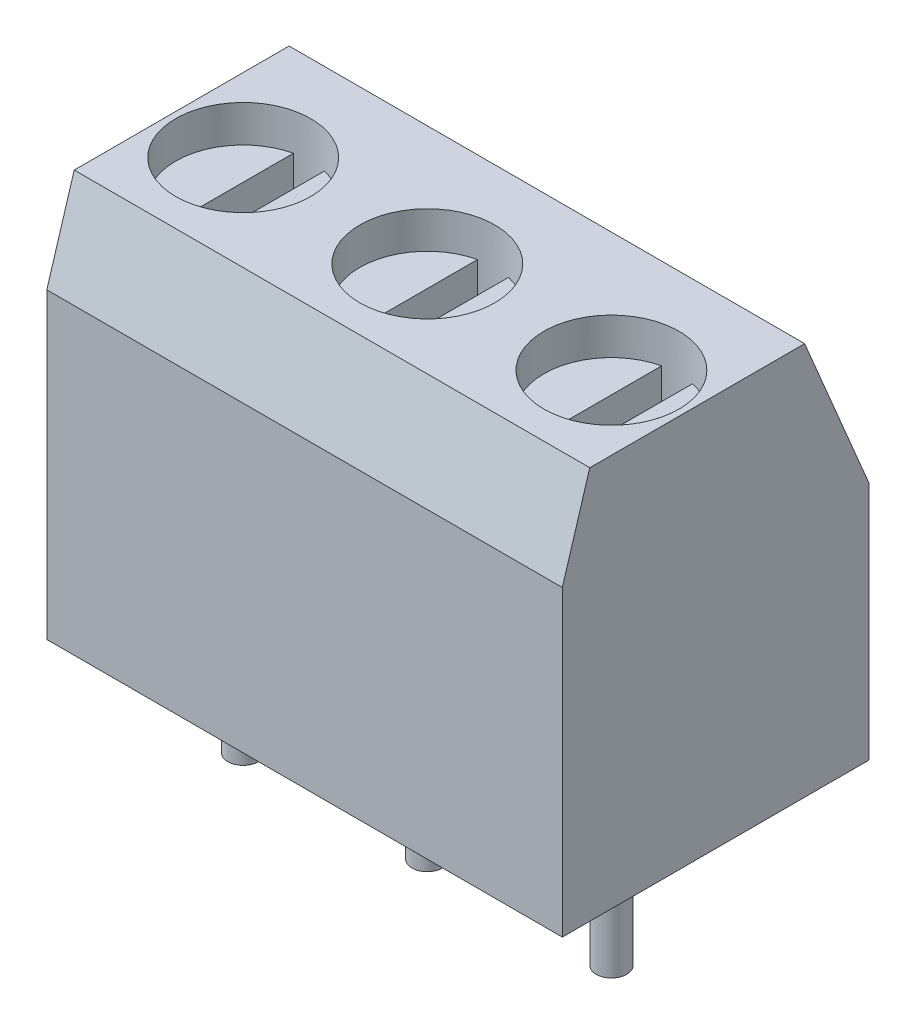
ISO-10303-21;
HEADER;
FILE_DESCRIPTION(('STEP AP214'),'2;1');
FILE_NAME('part.step','',(''),(''),'','','');
FILE_SCHEMA(('AUTOMOTIVE_DESIGN { 1 0 10303 214 1 1 1 1 }'));
ENDSEC;
DATA;
#1=APPLICATION_CONTEXT('core data for automotive mechanical design processes');
#2=APPLICATION_PROTOCOL_DEFINITION('international standard','automotive_design',2000,#1);
#3=PRODUCT_CONTEXT('',#1,'mechanical');
#4=PRODUCT('Part','Part','',(#3));
#5=PRODUCT_RELATED_PRODUCT_CATEGORY('part','',(#4));
#6=PRODUCT_DEFINITION_FORMATION('','',#4);
#7=PRODUCT_DEFINITION_CONTEXT('part definition',#1,'design');
#8=PRODUCT_DEFINITION('design','',#6,#7);
#9=PRODUCT_DEFINITION_SHAPE('','',#8);
#10=(LENGTH_UNIT() NAMED_UNIT(*) SI_UNIT(.MILLI.,.METRE.));
#11=(NAMED_UNIT(*) PLANE_ANGLE_UNIT() SI_UNIT($,.RADIAN.));
#12=(NAMED_UNIT(*) SI_UNIT($,.STERADIAN.) SOLID_ANGLE_UNIT());
#13=UNCERTAINTY_MEASURE_WITH_UNIT(LENGTH_MEASURE(1.E-05),#10,'distance_accuracy_value','');
#14=(GEOMETRIC_REPRESENTATION_CONTEXT(3) GLOBAL_UNCERTAINTY_ASSIGNED_CONTEXT((#13)) GLOBAL_UNIT_ASSIGNED_CONTEXT((#10,
#11,#12)) REPRESENTATION_CONTEXT('',''));
#15=CARTESIAN_POINT('',(0.,0.,0.));
#16=DIRECTION('',(0.,0.,1.));
#17=DIRECTION('',(1.,0.,0.));
#18=AXIS2_PLACEMENT_3D('',#15,#16,#17);
#19=CARTESIAN_POINT('',(47.6665117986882,8.128,-51.8858533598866));
#20=DIRECTION('',(0.,1.,0.));
#21=DIRECTION('',(1.,0.,0.));
#22=AXIS2_PLACEMENT_3D('',#19,#20,#21);
#23=PLANE('',#22);
#24=CARTESIAN_POINT('',(48.006,8.128,-53.34));
#25=DIRECTION('',(0.,1.,0.));
#26=DIRECTION('',(0.,0.,1.));
#27=AXIS2_PLACEMENT_3D('',#24,#25,#26);
#28=CIRCLE('',#27,1.397);
#29=CARTESIAN_POINT('',(47.6861542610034,8.12800000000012,-51.9801074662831));
#30=VERTEX_POINT('',#29);
#31=CARTESIAN_POINT('',(48.3258457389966,8.12800000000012,-51.9801074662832));
#32=VERTEX_POINT('',#31);
#33=EDGE_CURVE('E132',#30,#32,#28,.T.);
#34=ORIENTED_EDGE('',*,*,#33,.T.);
#35=DIRECTION('',(0.,0.,-1.));
#36=VECTOR('',#35,1.);
#37=CARTESIAN_POINT('',(48.3258457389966,8.12800000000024,-53.34));
#38=LINE('',#37,#36);
#39=CARTESIAN_POINT('',(48.3258457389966,8.12800000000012,-54.6998925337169));
#40=VERTEX_POINT('',#39);
#41=EDGE_CURVE('E136',#32,#40,#38,.T.);
#42=ORIENTED_EDGE('',*,*,#41,.T.);
#43=CARTESIAN_POINT('',(48.006,8.128,-53.34));
#44=DIRECTION('',(0.,1.,0.));
#45=DIRECTION('',(0.,0.,1.));
#46=AXIS2_PLACEMENT_3D('',#43,#44,#45);
#47=CIRCLE('',#46,1.397);
#48=CARTESIAN_POINT('',(47.6861542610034,8.12800000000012,-54.6998925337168));
#49=VERTEX_POINT('',#48);
#50=EDGE_CURVE('E20',#40,#49,#47,.T.);
#51=ORIENTED_EDGE('',*,*,#50,.T.);
#52=DIRECTION('',(0.,0.,1.));
#53=VECTOR('',#52,1.);
#54=CARTESIAN_POINT('',(47.6861542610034,8.12800000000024,-53.34));
#55=LINE('',#54,#53);
#56=EDGE_CURVE('E150',#49,#30,#55,.T.);
#57=ORIENTED_EDGE('',*,*,#56,.T.);
#58=EDGE_LOOP('',(#34,#42,#51,#57));
#59=FACE_BOUND('',#58,.T.);
#60=ADVANCED_FACE('F16',(#59),#23,.T.);
#61=CARTESIAN_POINT('',(43.8565117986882,8.128,-51.8858533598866));
#62=DIRECTION('',(0.,1.,0.));
#63=DIRECTION('',(1.,0.,0.));
#64=AXIS2_PLACEMENT_3D('',#61,#62,#63);
#65=PLANE('',#64);
#66=CARTESIAN_POINT('',(44.196,8.128,-53.34));
#67=DIRECTION('',(0.,1.,0.));
#68=DIRECTION('',(0.,0.,1.));
#69=AXIS2_PLACEMENT_3D('',#66,#67,#68);
#70=CIRCLE('',#69,1.397);
#71=CARTESIAN_POINT('',(43.8761542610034,8.12800000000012,-51.9801074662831));
#72=VERTEX_POINT('',#71);
#73=CARTESIAN_POINT('',(44.5158457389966,8.12800000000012,-51.9801074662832));
#74=VERTEX_POINT('',#73);
#75=EDGE_CURVE('E247',#72,#74,#70,.T.);
#76=ORIENTED_EDGE('',*,*,#75,.T.);
#77=DIRECTION('',(0.,0.,-1.));
#78=VECTOR('',#77,1.);
#79=CARTESIAN_POINT('',(44.5158457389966,8.12800000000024,-53.34));
#80=LINE('',#79,#78);
#81=CARTESIAN_POINT('',(44.5158457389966,8.12800000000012,-54.6998925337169));
#82=VERTEX_POINT('',#81);
#83=EDGE_CURVE('E256',#74,#82,#80,.T.);
#84=ORIENTED_EDGE('',*,*,#83,.T.);
#85=CARTESIAN_POINT('',(44.196,8.128,-53.34));
#86=DIRECTION('',(0.,1.,0.));
#87=DIRECTION('',(0.,0.,1.));
#88=AXIS2_PLACEMENT_3D('',#85,#86,#87);
#89=CIRCLE('',#88,1.397);
#90=CARTESIAN_POINT('',(43.8761542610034,8.12800000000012,-54.6998925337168));
#91=VERTEX_POINT('',#90);
#92=EDGE_CURVE('E249',#82,#91,#89,.T.);
#93=ORIENTED_EDGE('',*,*,#92,.T.);
#94=DIRECTION('',(0.,0.,1.));
#95=VECTOR('',#94,1.);
#96=CARTESIAN_POINT('',(43.8761542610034,8.12800000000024,-53.34));
#97=LINE('',#96,#95);
#98=EDGE_CURVE('E148',#91,#72,#97,.T.);
#99=ORIENTED_EDGE('',*,*,#98,.T.);
#100=EDGE_LOOP('',(#76,#84,#93,#99));
#101=FACE_BOUND('',#100,.T.);
#102=ADVANCED_FACE('F254',(#101),#65,.T.);
#103=CARTESIAN_POINT('',(40.0465117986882,8.128,-51.8858533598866));
#104=DIRECTION('',(0.,1.,0.));
#105=DIRECTION('',(1.,0.,0.));
#106=AXIS2_PLACEMENT_3D('',#103,#104,#105);
#107=PLANE('',#106);
#108=CARTESIAN_POINT('',(40.386,8.128,-53.34));
#109=DIRECTION('',(0.,1.,0.));
#110=DIRECTION('',(0.,0.,1.));
#111=AXIS2_PLACEMENT_3D('',#108,#109,#110);
#112=CIRCLE('',#111,1.397);
#113=CARTESIAN_POINT('',(40.0661542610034,8.12800000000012,-51.9801074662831));
#114=VERTEX_POINT('',#113);
#115=CARTESIAN_POINT('',(40.7058457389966,8.12800000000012,-51.9801074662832));
#116=VERTEX_POINT('',#115);
#117=EDGE_CURVE('E243',#114,#116,#112,.T.);
#118=ORIENTED_EDGE('',*,*,#117,.T.);
#119=DIRECTION('',(0.,0.,-1.));
#120=VECTOR('',#119,1.);
#121=CARTESIAN_POINT('',(40.7058457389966,8.12800000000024,-53.34));
#122=LINE('',#121,#120);
#123=CARTESIAN_POINT('',(40.7058457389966,8.12800000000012,-54.6998925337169));
#124=VERTEX_POINT('',#123);
#125=EDGE_CURVE('E276',#116,#124,#122,.T.);
#126=ORIENTED_EDGE('',*,*,#125,.T.);
#127=CARTESIAN_POINT('',(40.386,8.128,-53.34));
#128=DIRECTION('',(0.,1.,0.));
#129=DIRECTION('',(0.,0.,1.));
#130=AXIS2_PLACEMENT_3D('',#127,#128,#129);
#131=CIRCLE('',#130,1.397);
#132=CARTESIAN_POINT('',(40.0661542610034,8.12800000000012,-54.6998925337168));
#133=VERTEX_POINT('',#132);
#134=EDGE_CURVE('E245',#124,#133,#131,.T.);
#135=ORIENTED_EDGE('',*,*,#134,.T.);
#136=DIRECTION('',(0.,0.,1.));
#137=VECTOR('',#136,1.);
#138=CARTESIAN_POINT('',(40.0661542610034,8.12800000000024,-53.34));
#139=LINE('',#138,#137);
#140=EDGE_CURVE('E280',#133,#114,#139,.T.);
#141=ORIENTED_EDGE('',*,*,#140,.T.);
#142=EDGE_LOOP('',(#118,#126,#135,#141));
#143=FACE_BOUND('',#142,.T.);
#144=ADVANCED_FACE('F1044',(#143),#107,.T.);
#145=CARTESIAN_POINT('',(39.33444,2.88544,-52.07));
#146=DIRECTION('',(0.,0.,1.));
#147=DIRECTION('',(1.,0.,0.));
#148=AXIS2_PLACEMENT_3D('',#145,#146,#147);
#149=PLANE('',#148);
#150=CARTESIAN_POINT('',(40.259,3.80999999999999,-52.0700000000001));
#151=DIRECTION('',(0.,0.,1.));
#152=DIRECTION('',(0.,-1.,0.));
#153=AXIS2_PLACEMENT_3D('',#150,#151,#152);
#154=CIRCLE('',#153,0.889000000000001);
#155=CARTESIAN_POINT('',(40.259,2.92099999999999,-52.0700000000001));
#156=VERTEX_POINT('',#155);
#157=EDGE_CURVE('E239',#156,#156,#154,.T.);
#158=ORIENTED_EDGE('',*,*,#157,.F.);
#159=EDGE_LOOP('',(#158));
#160=FACE_BOUND('',#159,.T.);
#161=ADVANCED_FACE('F1034',(#160),#149,.F.);
#162=CARTESIAN_POINT('',(43.14444,2.88544,-52.07));
#163=DIRECTION('',(0.,0.,1.));
#164=DIRECTION('',(1.,0.,0.));
#165=AXIS2_PLACEMENT_3D('',#162,#163,#164);
#166=PLANE('',#165);
#167=CARTESIAN_POINT('',(44.069,3.80999999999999,-52.0700000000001));
#168=DIRECTION('',(0.,0.,1.));
#169=DIRECTION('',(0.,-1.,0.));
#170=AXIS2_PLACEMENT_3D('',#167,#168,#169);
#171=CIRCLE('',#170,0.889000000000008);
#172=CARTESIAN_POINT('',(44.069,2.92099999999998,-52.0700000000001));
#173=VERTEX_POINT('',#172);
#174=EDGE_CURVE('E236',#173,#173,#171,.T.);
#175=ORIENTED_EDGE('',*,*,#174,.F.);
#176=EDGE_LOOP('',(#175));
#177=FACE_BOUND('',#176,.T.);
#178=ADVANCED_FACE('F1024',(#177),#166,.F.);
#179=CARTESIAN_POINT('',(46.95444,2.88544,-52.07));
#180=DIRECTION('',(0.,0.,1.));
#181=DIRECTION('',(1.,0.,0.));
#182=AXIS2_PLACEMENT_3D('',#179,#180,#181);
#183=PLANE('',#182);
#184=CARTESIAN_POINT('',(47.879,3.80999999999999,-52.0700000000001));
#185=DIRECTION('',(0.,0.,1.));
#186=DIRECTION('',(0.,-1.,0.));
#187=AXIS2_PLACEMENT_3D('',#184,#185,#186);
#188=CIRCLE('',#187,0.889000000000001);
#189=CARTESIAN_POINT('',(47.879,2.92099999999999,-52.0700000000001));
#190=VERTEX_POINT('',#189);
#191=EDGE_CURVE('E232',#190,#190,#188,.T.);
#192=ORIENTED_EDGE('',*,*,#191,.F.);
#193=EDGE_LOOP('',(#192));
#194=FACE_BOUND('',#193,.T.);
#195=ADVANCED_FACE('F1014',(#194),#183,.F.);
#196=CARTESIAN_POINT('',(47.6861542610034,8.10835753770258,-54.7542882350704));
#197=DIRECTION('',(-1.,0.,0.));
#198=DIRECTION('',(0.,0.,1.));
#199=AXIS2_PLACEMENT_3D('',#196,#197,#198);
#200=PLANE('',#199);
#201=ORIENTED_EDGE('',*,*,#56,.F.);
#202=DIRECTION('',(0.,-1.,0.));
#203=VECTOR('',#202,1.);
#204=CARTESIAN_POINT('',(47.6861542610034,8.509,-54.6998925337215));
#205=LINE('',#204,#203);
#206=CARTESIAN_POINT('',(47.6861542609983,8.89,-54.6998925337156));
#207=VERTEX_POINT('',#206);
#208=EDGE_CURVE('E127',#207,#49,#205,.T.);
#209=ORIENTED_EDGE('',*,*,#208,.F.);
#210=DIRECTION('',(0.,0.,-1.));
#211=VECTOR('',#210,1.);
#212=CARTESIAN_POINT('',(47.6861542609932,8.89,-53.34));
#213=LINE('',#212,#211);
#214=CARTESIAN_POINT('',(47.6861542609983,8.89,-51.9801074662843));
#215=VERTEX_POINT('',#214);
#216=EDGE_CURVE('E235',#215,#207,#213,.T.);
#217=ORIENTED_EDGE('',*,*,#216,.F.);
#218=DIRECTION('',(0.,1.,0.));
#219=VECTOR('',#218,1.);
#220=CARTESIAN_POINT('',(47.6861542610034,8.509,-51.9801074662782));
#221=LINE('',#220,#219);
#222=EDGE_CURVE('E144',#30,#215,#221,.T.);
#223=ORIENTED_EDGE('',*,*,#222,.F.);
#224=EDGE_LOOP('',(#201,#209,#217,#223));
#225=FACE_BOUND('',#224,.T.);
#226=ADVANCED_FACE('F1005',(#225),#200,.F.);
#227=CARTESIAN_POINT('',(48.3258457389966,8.10835753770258,-51.9257117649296));
#228=DIRECTION('',(1.,0.,0.));
#229=DIRECTION('',(0.,0.,-1.));
#230=AXIS2_PLACEMENT_3D('',#227,#228,#229);
#231=PLANE('',#230);
#232=ORIENTED_EDGE('',*,*,#41,.F.);
#233=DIRECTION('',(0.,-1.,0.));
#234=VECTOR('',#233,1.);
#235=CARTESIAN_POINT('',(48.3258457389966,8.509,-51.9801074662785));
#236=LINE('',#235,#234);
#237=CARTESIAN_POINT('',(48.3258457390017,8.89,-51.9801074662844));
#238=VERTEX_POINT('',#237);
#239=EDGE_CURVE('E142',#238,#32,#236,.T.);
#240=ORIENTED_EDGE('',*,*,#239,.F.);
#241=DIRECTION('',(0.,0.,1.));
#242=VECTOR('',#241,1.);
#243=CARTESIAN_POINT('',(48.3258457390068,8.89,-53.34));
#244=LINE('',#243,#242);
#245=CARTESIAN_POINT('',(48.3258457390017,8.89,-54.6998925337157));
#246=VERTEX_POINT('',#245);
#247=EDGE_CURVE('E139',#246,#238,#244,.T.);
#248=ORIENTED_EDGE('',*,*,#247,.F.);
#249=DIRECTION('',(0.,1.,0.));
#250=VECTOR('',#249,1.);
#251=CARTESIAN_POINT('',(48.3258457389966,8.509,-54.6998925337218));
#252=LINE('',#251,#250);
#253=EDGE_CURVE('E124',#40,#246,#252,.T.);
#254=ORIENTED_EDGE('',*,*,#253,.F.);
#255=EDGE_LOOP('',(#232,#240,#248,#254));
#256=FACE_BOUND('',#255,.T.);
#257=ADVANCED_FACE('F135',(#256),#231,.F.);
#258=CARTESIAN_POINT('',(43.8761542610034,8.10835753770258,-54.7542882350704));
#259=DIRECTION('',(-1.,0.,0.));
#260=DIRECTION('',(0.,0.,1.));
#261=AXIS2_PLACEMENT_3D('',#258,#259,#260);
#262=PLANE('',#261);
#263=ORIENTED_EDGE('',*,*,#98,.F.);
#264=DIRECTION('',(0.,-1.,0.));
#265=VECTOR('',#264,1.);
#266=CARTESIAN_POINT('',(43.8761542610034,8.509,-54.6998925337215));
#267=LINE('',#266,#265);
#268=CARTESIAN_POINT('',(43.8761542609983,8.89,-54.6998925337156));
#269=VERTEX_POINT('',#268);
#270=EDGE_CURVE('E140',#269,#91,#267,.T.);
#271=ORIENTED_EDGE('',*,*,#270,.F.);
#272=DIRECTION('',(0.,0.,-1.));
#273=VECTOR('',#272,1.);
#274=CARTESIAN_POINT('',(43.8761542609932,8.89,-53.34));
#275=LINE('',#274,#273);
#276=CARTESIAN_POINT('',(43.8761542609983,8.89,-51.9801074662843));
#277=VERTEX_POINT('',#276);
#278=EDGE_CURVE('E299',#277,#269,#275,.T.);
#279=ORIENTED_EDGE('',*,*,#278,.F.);
#280=DIRECTION('',(0.,1.,0.));
#281=VECTOR('',#280,1.);
#282=CARTESIAN_POINT('',(43.8761542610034,8.509,-51.9801074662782));
#283=LINE('',#282,#281);
#284=EDGE_CURVE('E267',#72,#277,#283,.T.);
#285=ORIENTED_EDGE('',*,*,#284,.F.);
#286=EDGE_LOOP('',(#263,#271,#279,#285));
#287=FACE_BOUND('',#286,.T.);
#288=ADVANCED_FACE('F264',(#287),#262,.F.);
#289=CARTESIAN_POINT('',(44.5158457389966,8.10835753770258,-51.9257117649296));
#290=DIRECTION('',(1.,0.,0.));
#291=DIRECTION('',(0.,0.,-1.));
#292=AXIS2_PLACEMENT_3D('',#289,#290,#291);
#293=PLANE('',#292);
#294=ORIENTED_EDGE('',*,*,#83,.F.);
#295=DIRECTION('',(0.,-1.,0.));
#296=VECTOR('',#295,1.);
#297=CARTESIAN_POINT('',(44.5158457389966,8.509,-51.9801074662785));
#298=LINE('',#297,#296);
#299=CARTESIAN_POINT('',(44.5158457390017,8.89,-51.9801074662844));
#300=VERTEX_POINT('',#299);
#301=EDGE_CURVE('E285',#300,#74,#298,.T.);
#302=ORIENTED_EDGE('',*,*,#301,.F.);
#303=DIRECTION('',(0.,0.,1.));
#304=VECTOR('',#303,1.);
#305=CARTESIAN_POINT('',(44.5158457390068,8.89,-53.34));
#306=LINE('',#305,#304);
#307=CARTESIAN_POINT('',(44.5158457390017,8.89,-54.6998925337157));
#308=VERTEX_POINT('',#307);
#309=EDGE_CURVE('E301',#308,#300,#306,.T.);
#310=ORIENTED_EDGE('',*,*,#309,.F.);
#311=DIRECTION('',(0.,1.,0.));
#312=VECTOR('',#311,1.);
#313=CARTESIAN_POINT('',(44.5158457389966,8.509,-54.6998925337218));
#314=LINE('',#313,#312);
#315=EDGE_CURVE('E284',#82,#308,#314,.T.);
#316=ORIENTED_EDGE('',*,*,#315,.F.);
#317=EDGE_LOOP('',(#294,#302,#310,#316));
#318=FACE_BOUND('',#317,.T.);
#319=ADVANCED_FACE('F978',(#318),#293,.F.);
#320=CARTESIAN_POINT('',(40.0661542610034,8.10835753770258,-54.7542882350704));
#321=DIRECTION('',(-1.,0.,0.));
#322=DIRECTION('',(0.,0.,1.));
#323=AXIS2_PLACEMENT_3D('',#320,#321,#322);
#324=PLANE('',#323);
#325=ORIENTED_EDGE('',*,*,#140,.F.);
#326=DIRECTION('',(0.,-1.,0.));
#327=VECTOR('',#326,1.);
#328=CARTESIAN_POINT('',(40.0661542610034,8.509,-54.6998925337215));
#329=LINE('',#328,#327);
#330=CARTESIAN_POINT('',(40.0661542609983,8.89,-54.6998925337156));
#331=VERTEX_POINT('',#330);
#332=EDGE_CURVE('E283',#331,#133,#329,.T.);
#333=ORIENTED_EDGE('',*,*,#332,.F.);
#334=DIRECTION('',(0.,0.,-1.));
#335=VECTOR('',#334,1.);
#336=CARTESIAN_POINT('',(40.0661542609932,8.89,-53.34));
#337=LINE('',#336,#335);
#338=CARTESIAN_POINT('',(40.0661542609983,8.89,-51.9801074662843));
#339=VERTEX_POINT('',#338);
#340=EDGE_CURVE('E304',#339,#331,#337,.T.);
#341=ORIENTED_EDGE('',*,*,#340,.F.);
#342=DIRECTION('',(0.,1.,0.));
#343=VECTOR('',#342,1.);
#344=CARTESIAN_POINT('',(40.0661542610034,8.509,-51.9801074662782));
#345=LINE('',#344,#343);
#346=EDGE_CURVE('E282',#114,#339,#345,.T.);
#347=ORIENTED_EDGE('',*,*,#346,.F.);
#348=EDGE_LOOP('',(#325,#333,#341,#347));
#349=FACE_BOUND('',#348,.T.);
#350=ADVANCED_FACE('F968',(#349),#324,.F.);
#351=CARTESIAN_POINT('',(40.7058457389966,8.10835753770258,-51.9257117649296));
#352=DIRECTION('',(1.,0.,0.));
#353=DIRECTION('',(0.,0.,-1.));
#354=AXIS2_PLACEMENT_3D('',#351,#352,#353);
#355=PLANE('',#354);
#356=ORIENTED_EDGE('',*,*,#125,.F.);
#357=DIRECTION('',(0.,-1.,0.));
#358=VECTOR('',#357,1.);
#359=CARTESIAN_POINT('',(40.7058457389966,8.509,-51.9801074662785));
#360=LINE('',#359,#358);
#361=CARTESIAN_POINT('',(40.7058457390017,8.89,-51.9801074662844));
#362=VERTEX_POINT('',#361);
#363=EDGE_CURVE('E279',#362,#116,#360,.T.);
#364=ORIENTED_EDGE('',*,*,#363,.F.);
#365=DIRECTION('',(0.,0.,1.));
#366=VECTOR('',#365,1.);
#367=CARTESIAN_POINT('',(40.7058457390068,8.89,-53.34));
#368=LINE('',#367,#366);
#369=CARTESIAN_POINT('',(40.7058457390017,8.89,-54.6998925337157));
#370=VERTEX_POINT('',#369);
#371=EDGE_CURVE('E231',#370,#362,#368,.T.);
#372=ORIENTED_EDGE('',*,*,#371,.F.);
#373=DIRECTION('',(0.,1.,0.));
#374=VECTOR('',#373,1.);
#375=CARTESIAN_POINT('',(40.7058457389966,8.509,-54.6998925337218));
#376=LINE('',#375,#374);
#377=EDGE_CURVE('E242',#124,#370,#376,.T.);
#378=ORIENTED_EDGE('',*,*,#377,.F.);
#379=EDGE_LOOP('',(#356,#364,#372,#378));
#380=FACE_BOUND('',#379,.T.);
#381=ADVANCED_FACE('F958',(#380),#355,.F.);
#382=CARTESIAN_POINT('',(40.259,3.81,-54.61));
#383=DIRECTION('',(0.,0.,1.));
#384=DIRECTION('',(0.,-1.,0.));
#385=AXIS2_PLACEMENT_3D('',#382,#383,#384);
#386=CYLINDRICAL_SURFACE('',#385,0.889000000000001);
#387=ORIENTED_EDGE('',*,*,#157,.T.);
#388=EDGE_LOOP('',(#387));
#389=FACE_BOUND('',#388,.T.);
#390=CARTESIAN_POINT('',(40.259,3.81,-54.61));
#391=DIRECTION('',(0.,0.,1.));
#392=DIRECTION('',(0.,-1.,0.));
#393=AXIS2_PLACEMENT_3D('',#390,#391,#392);
#394=CIRCLE('',#393,0.889000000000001);
#395=CARTESIAN_POINT('',(40.259,2.921,-54.61));
#396=VERTEX_POINT('',#395);
#397=EDGE_CURVE('E228',#396,#396,#394,.T.);
#398=ORIENTED_EDGE('',*,*,#397,.F.);
#399=EDGE_LOOP('',(#398));
#400=FACE_BOUND('',#399,.T.);
#401=ADVANCED_FACE('F948',(#389,#400),#386,.F.);
#402=CARTESIAN_POINT('',(44.069,3.81,-54.61));
#403=DIRECTION('',(0.,0.,1.));
#404=DIRECTION('',(0.,-1.,0.));
#405=AXIS2_PLACEMENT_3D('',#402,#403,#404);
#406=CYLINDRICAL_SURFACE('',#405,0.889000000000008);
#407=ORIENTED_EDGE('',*,*,#174,.T.);
#408=EDGE_LOOP('',(#407));
#409=FACE_BOUND('',#408,.T.);
#410=CARTESIAN_POINT('',(44.069,3.81,-54.61));
#411=DIRECTION('',(0.,0.,1.));
#412=DIRECTION('',(0.,-1.,0.));
#413=AXIS2_PLACEMENT_3D('',#410,#411,#412);
#414=CIRCLE('',#413,0.889000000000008);
#415=CARTESIAN_POINT('',(44.069,2.92099999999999,-54.61));
#416=VERTEX_POINT('',#415);
#417=EDGE_CURVE('E225',#416,#416,#414,.T.);
#418=ORIENTED_EDGE('',*,*,#417,.F.);
#419=EDGE_LOOP('',(#418));
#420=FACE_BOUND('',#419,.T.);
#421=ADVANCED_FACE('F938',(#409,#420),#406,.F.);
#422=CARTESIAN_POINT('',(47.879,3.81,-54.61));
#423=DIRECTION('',(0.,0.,1.));
#424=DIRECTION('',(0.,-1.,0.));
#425=AXIS2_PLACEMENT_3D('',#422,#423,#424);
#426=CYLINDRICAL_SURFACE('',#425,0.889000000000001);
#427=ORIENTED_EDGE('',*,*,#191,.T.);
#428=EDGE_LOOP('',(#427));
#429=FACE_BOUND('',#428,.T.);
#430=CARTESIAN_POINT('',(47.879,3.81,-54.61));
#431=DIRECTION('',(0.,0.,1.));
#432=DIRECTION('',(0.,-1.,0.));
#433=AXIS2_PLACEMENT_3D('',#430,#431,#432);
#434=CIRCLE('',#433,0.889000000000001);
#435=CARTESIAN_POINT('',(47.879,2.921,-54.61));
#436=VERTEX_POINT('',#435);
#437=EDGE_CURVE('E222',#436,#436,#434,.T.);
#438=ORIENTED_EDGE('',*,*,#437,.F.);
#439=EDGE_LOOP('',(#438));
#440=FACE_BOUND('',#439,.T.);
#441=ADVANCED_FACE('F928',(#429,#440),#426,.F.);
#442=CARTESIAN_POINT('',(47.6688575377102,-1.016,-53.0019519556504));
#443=DIRECTION('',(0.,1.,0.));
#444=DIRECTION('',(1.,0.,0.));
#445=AXIS2_PLACEMENT_3D('',#442,#443,#444);
#446=PLANE('',#445);
#447=CARTESIAN_POINT('',(48.006,-1.016,-53.34));
#448=DIRECTION('',(0.,1.,0.));
#449=DIRECTION('',(0.,0.,1.));
#450=AXIS2_PLACEMENT_3D('',#447,#448,#449);
#451=CIRCLE('',#450,0.317499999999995);
#452=CARTESIAN_POINT('',(48.006,-1.016,-53.0225));
#453=VERTEX_POINT('',#452);
#454=EDGE_CURVE('E219',#453,#453,#451,.F.);
#455=ORIENTED_EDGE('',*,*,#454,.T.);
#456=EDGE_LOOP('',(#455));
#457=FACE_BOUND('',#456,.T.);
#458=ADVANCED_FACE('F918',(#457),#446,.F.);
#459=CARTESIAN_POINT('',(43.8588575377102,-1.016,-53.0019519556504));
#460=DIRECTION('',(0.,1.,0.));
#461=DIRECTION('',(1.,0.,0.));
#462=AXIS2_PLACEMENT_3D('',#459,#460,#461);
#463=PLANE('',#462);
#464=CARTESIAN_POINT('',(44.196,-1.016,-53.34));
#465=DIRECTION('',(0.,1.,0.));
#466=DIRECTION('',(0.,0.,1.));
#467=AXIS2_PLACEMENT_3D('',#464,#465,#466);
#468=CIRCLE('',#467,0.317499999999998);
#469=CARTESIAN_POINT('',(44.196,-1.016,-53.0225));
#470=VERTEX_POINT('',#469);
#471=EDGE_CURVE('E216',#470,#470,#468,.F.);
#472=ORIENTED_EDGE('',*,*,#471,.T.);
#473=EDGE_LOOP('',(#472));
#474=FACE_BOUND('',#473,.T.);
#475=ADVANCED_FACE('F908',(#474),#463,.F.);
#476=CARTESIAN_POINT('',(40.0488575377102,-1.016,-53.0019519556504));
#477=DIRECTION('',(0.,1.,0.));
#478=DIRECTION('',(1.,0.,0.));
#479=AXIS2_PLACEMENT_3D('',#476,#477,#478);
#480=PLANE('',#479);
#481=CARTESIAN_POINT('',(40.386,-1.016,-53.34));
#482=DIRECTION('',(0.,1.,0.));
#483=DIRECTION('',(0.,0.,1.));
#484=AXIS2_PLACEMENT_3D('',#481,#482,#483);
#485=CIRCLE('',#484,0.317500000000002);
#486=CARTESIAN_POINT('',(40.386,-1.016,-53.0225));
#487=VERTEX_POINT('',#486);
#488=EDGE_CURVE('E212',#487,#487,#485,.F.);
#489=ORIENTED_EDGE('',*,*,#488,.T.);
#490=EDGE_LOOP('',(#489));
#491=FACE_BOUND('',#490,.T.);
#492=ADVANCED_FACE('F898',(#491),#480,.F.);
#493=CARTESIAN_POINT('',(46.55312,8.89,-51.9257117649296));
#494=DIRECTION('',(0.,1.,0.));
#495=DIRECTION('',(1.,0.,0.));
#496=AXIS2_PLACEMENT_3D('',#493,#494,#495);
#497=PLANE('',#496);
#498=ORIENTED_EDGE('',*,*,#216,.T.);
#499=CARTESIAN_POINT('',(48.006,8.89,-53.34));
#500=DIRECTION('',(0.,1.,0.));
#501=DIRECTION('',(0.,0.,1.));
#502=AXIS2_PLACEMENT_3D('',#499,#500,#501);
#503=CIRCLE('',#502,1.397);
#504=EDGE_CURVE('E209',#215,#207,#503,.F.);
#505=ORIENTED_EDGE('',*,*,#504,.F.);
#506=EDGE_LOOP('',(#498,#505));
#507=FACE_BOUND('',#506,.T.);
#508=ADVANCED_FACE('F888',(#507),#497,.T.);
#509=CARTESIAN_POINT('',(46.55312,8.89,-51.9257117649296));
#510=DIRECTION('',(0.,1.,0.));
#511=DIRECTION('',(1.,0.,0.));
#512=AXIS2_PLACEMENT_3D('',#509,#510,#511);
#513=PLANE('',#512);
#514=CARTESIAN_POINT('',(48.006,8.89,-53.34));
#515=DIRECTION('',(0.,1.,0.));
#516=DIRECTION('',(0.,0.,1.));
#517=AXIS2_PLACEMENT_3D('',#514,#515,#516);
#518=CIRCLE('',#517,1.397);
#519=EDGE_CURVE('E207',#246,#238,#518,.F.);
#520=ORIENTED_EDGE('',*,*,#519,.F.);
#521=ORIENTED_EDGE('',*,*,#247,.T.);
#522=EDGE_LOOP('',(#520,#521));
#523=FACE_BOUND('',#522,.T.);
#524=ADVANCED_FACE('F878',(#523),#513,.T.);
#525=CARTESIAN_POINT('',(42.74312,8.89,-51.9257117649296));
#526=DIRECTION('',(0.,1.,0.));
#527=DIRECTION('',(1.,0.,0.));
#528=AXIS2_PLACEMENT_3D('',#525,#526,#527);
#529=PLANE('',#528);
#530=ORIENTED_EDGE('',*,*,#278,.T.);
#531=CARTESIAN_POINT('',(44.196,8.89,-53.34));
#532=DIRECTION('',(0.,1.,0.));
#533=DIRECTION('',(0.,0.,1.));
#534=AXIS2_PLACEMENT_3D('',#531,#532,#533);
#535=CIRCLE('',#534,1.397);
#536=EDGE_CURVE('E205',#277,#269,#535,.F.);
#537=ORIENTED_EDGE('',*,*,#536,.F.);
#538=EDGE_LOOP('',(#530,#537));
#539=FACE_BOUND('',#538,.T.);
#540=ADVANCED_FACE('F868',(#539),#529,.T.);
#541=CARTESIAN_POINT('',(42.74312,8.89,-51.9257117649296));
#542=DIRECTION('',(0.,1.,0.));
#543=DIRECTION('',(1.,0.,0.));
#544=AXIS2_PLACEMENT_3D('',#541,#542,#543);
#545=PLANE('',#544);
#546=CARTESIAN_POINT('',(44.196,8.89,-53.34));
#547=DIRECTION('',(0.,1.,0.));
#548=DIRECTION('',(0.,0.,1.));
#549=AXIS2_PLACEMENT_3D('',#546,#547,#548);
#550=CIRCLE('',#549,1.397);
#551=EDGE_CURVE('E202',#308,#300,#550,.F.);
#552=ORIENTED_EDGE('',*,*,#551,.F.);
#553=ORIENTED_EDGE('',*,*,#309,.T.);
#554=EDGE_LOOP('',(#552,#553));
#555=FACE_BOUND('',#554,.T.);
#556=ADVANCED_FACE('F858',(#555),#545,.T.);
#557=CARTESIAN_POINT('',(38.93312,8.89,-51.9257117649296));
#558=DIRECTION('',(0.,1.,0.));
#559=DIRECTION('',(1.,0.,0.));
#560=AXIS2_PLACEMENT_3D('',#557,#558,#559);
#561=PLANE('',#560);
#562=ORIENTED_EDGE('',*,*,#340,.T.);
#563=CARTESIAN_POINT('',(40.386,8.89,-53.34));
#564=DIRECTION('',(0.,1.,0.));
#565=DIRECTION('',(0.,0.,1.));
#566=AXIS2_PLACEMENT_3D('',#563,#564,#565);
#567=CIRCLE('',#566,1.397);
#568=EDGE_CURVE('E200',#339,#331,#567,.F.);
#569=ORIENTED_EDGE('',*,*,#568,.F.);
#570=EDGE_LOOP('',(#562,#569));
#571=FACE_BOUND('',#570,.T.);
#572=ADVANCED_FACE('F849',(#571),#561,.T.);
#573=CARTESIAN_POINT('',(38.93312,8.89,-51.9257117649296));
#574=DIRECTION('',(0.,1.,0.));
#575=DIRECTION('',(1.,0.,0.));
#576=AXIS2_PLACEMENT_3D('',#573,#574,#575);
#577=PLANE('',#576);
#578=CARTESIAN_POINT('',(40.386,8.89,-53.34));
#579=DIRECTION('',(0.,1.,0.));
#580=DIRECTION('',(0.,0.,1.));
#581=AXIS2_PLACEMENT_3D('',#578,#579,#580);
#582=CIRCLE('',#581,1.397);
#583=EDGE_CURVE('E196',#370,#362,#582,.F.);
#584=ORIENTED_EDGE('',*,*,#583,.F.);
#585=ORIENTED_EDGE('',*,*,#371,.T.);
#586=EDGE_LOOP('',(#584,#585));
#587=FACE_BOUND('',#586,.T.);
#588=ADVANCED_FACE('F625',(#587),#577,.T.);
#589=CARTESIAN_POINT('',(41.7068,1.42748,-54.61));
#590=DIRECTION('',(0.,0.,-1.));
#591=DIRECTION('',(-1.,0.,0.));
#592=AXIS2_PLACEMENT_3D('',#589,#590,#591);
#593=PLANE('',#592);
#594=ORIENTED_EDGE('',*,*,#397,.T.);
#595=EDGE_LOOP('',(#594));
#596=FACE_BOUND('',#595,.T.);
#597=DIRECTION('',(1.,0.,0.));
#598=VECTOR('',#597,1.);
#599=CARTESIAN_POINT('',(40.386,6.35,-54.61));
#600=LINE('',#599,#598);
#601=CARTESIAN_POINT('',(39.116,6.35,-54.61));
#602=VERTEX_POINT('',#601);
#603=CARTESIAN_POINT('',(41.656,6.35,-54.61));
#604=VERTEX_POINT('',#603);
#605=EDGE_CURVE('E215',#602,#604,#600,.T.);
#606=ORIENTED_EDGE('',*,*,#605,.T.);
#607=DIRECTION('',(0.,-1.,0.));
#608=VECTOR('',#607,1.);
#609=CARTESIAN_POINT('',(41.656,3.937,-54.61));
#610=LINE('',#609,#608);
#611=CARTESIAN_POINT('',(41.656,1.524,-54.61));
#612=VERTEX_POINT('',#611);
#613=EDGE_CURVE('E211',#604,#612,#610,.T.);
#614=ORIENTED_EDGE('',*,*,#613,.T.);
#615=DIRECTION('',(1.,0.,0.));
#616=VECTOR('',#615,1.);
#617=CARTESIAN_POINT('',(44.196,1.524,-54.61));
#618=LINE('',#617,#616);
#619=CARTESIAN_POINT('',(39.116,1.524,-54.61));
#620=VERTEX_POINT('',#619);
#621=EDGE_CURVE('E199',#620,#612,#618,.T.);
#622=ORIENTED_EDGE('',*,*,#621,.F.);
#623=DIRECTION('',(0.,1.,0.));
#624=VECTOR('',#623,1.);
#625=CARTESIAN_POINT('',(39.116,3.937,-54.61));
#626=LINE('',#625,#624);
#627=EDGE_CURVE('E311',#620,#602,#626,.T.);
#628=ORIENTED_EDGE('',*,*,#627,.T.);
#629=EDGE_LOOP('',(#606,#614,#622,#628));
#630=FACE_BOUND('',#629,.T.);
#631=ADVANCED_FACE('F519',(#596,#630),#593,.T.);
#632=CARTESIAN_POINT('',(45.5168,1.42748,-54.61));
#633=DIRECTION('',(0.,0.,-1.));
#634=DIRECTION('',(-1.,0.,0.));
#635=AXIS2_PLACEMENT_3D('',#632,#633,#634);
#636=PLANE('',#635);
#637=ORIENTED_EDGE('',*,*,#417,.T.);
#638=EDGE_LOOP('',(#637));
#639=FACE_BOUND('',#638,.T.);
#640=DIRECTION('',(1.,0.,0.));
#641=VECTOR('',#640,1.);
#642=CARTESIAN_POINT('',(44.196,6.35,-54.61));
#643=LINE('',#642,#641);
#644=CARTESIAN_POINT('',(42.926,6.35,-54.61));
#645=VERTEX_POINT('',#644);
#646=CARTESIAN_POINT('',(45.466,6.35,-54.61));
#647=VERTEX_POINT('',#646);
#648=EDGE_CURVE('E335',#645,#647,#643,.T.);
#649=ORIENTED_EDGE('',*,*,#648,.T.);
#650=DIRECTION('',(0.,-1.,0.));
#651=VECTOR('',#650,1.);
#652=CARTESIAN_POINT('',(45.466,3.937,-54.61));
#653=LINE('',#652,#651);
#654=CARTESIAN_POINT('',(45.466,1.524,-54.61));
#655=VERTEX_POINT('',#654);
#656=EDGE_CURVE('E332',#647,#655,#653,.T.);
#657=ORIENTED_EDGE('',*,*,#656,.T.);
#658=DIRECTION('',(1.,0.,0.));
#659=VECTOR('',#658,1.);
#660=CARTESIAN_POINT('',(44.196,1.524,-54.61));
#661=LINE('',#660,#659);
#662=CARTESIAN_POINT('',(42.926,1.524,-54.61));
#663=VERTEX_POINT('',#662);
#664=EDGE_CURVE('E360',#663,#655,#661,.T.);
#665=ORIENTED_EDGE('',*,*,#664,.F.);
#666=DIRECTION('',(0.,1.,0.));
#667=VECTOR('',#666,1.);
#668=CARTESIAN_POINT('',(42.926,3.937,-54.61));
#669=LINE('',#668,#667);
#670=EDGE_CURVE('E341',#663,#645,#669,.T.);
#671=ORIENTED_EDGE('',*,*,#670,.T.);
#672=EDGE_LOOP('',(#649,#657,#665,#671));
#673=FACE_BOUND('',#672,.T.);
#674=ADVANCED_FACE('F613',(#639,#673),#636,.T.);
#675=CARTESIAN_POINT('',(49.3268,1.42748,-54.61));
#676=DIRECTION('',(0.,0.,-1.));
#677=DIRECTION('',(-1.,0.,0.));
#678=AXIS2_PLACEMENT_3D('',#675,#676,#677);
#679=PLANE('',#678);
#680=ORIENTED_EDGE('',*,*,#437,.T.);
#681=EDGE_LOOP('',(#680));
#682=FACE_BOUND('',#681,.T.);
#683=DIRECTION('',(1.,0.,0.));
#684=VECTOR('',#683,1.);
#685=CARTESIAN_POINT('',(48.006,6.35,-54.61));
#686=LINE('',#685,#684);
#687=CARTESIAN_POINT('',(46.736,6.35,-54.61));
#688=VERTEX_POINT('',#687);
#689=CARTESIAN_POINT('',(49.276,6.35,-54.61));
#690=VERTEX_POINT('',#689);
#691=EDGE_CURVE('E320',#688,#690,#686,.T.);
#692=ORIENTED_EDGE('',*,*,#691,.T.);
#693=DIRECTION('',(0.,-1.,0.));
#694=VECTOR('',#693,1.);
#695=CARTESIAN_POINT('',(49.276,3.937,-54.61));
#696=LINE('',#695,#694);
#697=CARTESIAN_POINT('',(49.276,1.524,-54.61));
#698=VERTEX_POINT('',#697);
#699=EDGE_CURVE('E317',#690,#698,#696,.T.);
#700=ORIENTED_EDGE('',*,*,#699,.T.);
#701=DIRECTION('',(1.,0.,0.));
#702=VECTOR('',#701,1.);
#703=CARTESIAN_POINT('',(44.196,1.524,-54.61));
#704=LINE('',#703,#702);
#705=CARTESIAN_POINT('',(46.736,1.524,-54.61));
#706=VERTEX_POINT('',#705);
#707=EDGE_CURVE('E369',#706,#698,#704,.T.);
#708=ORIENTED_EDGE('',*,*,#707,.F.);
#709=DIRECTION('',(0.,1.,0.));
#710=VECTOR('',#709,1.);
#711=CARTESIAN_POINT('',(46.736,3.937,-54.61));
#712=LINE('',#711,#710);
#713=EDGE_CURVE('E326',#706,#688,#712,.T.);
#714=ORIENTED_EDGE('',*,*,#713,.T.);
#715=EDGE_LOOP('',(#692,#700,#708,#714));
#716=FACE_BOUND('',#715,.T.);
#717=ADVANCED_FACE('F615',(#682,#716),#679,.T.);
#718=CARTESIAN_POINT('',(48.006,-1.016,-53.34));
#719=DIRECTION('',(0.,1.,0.));
#720=DIRECTION('',(0.,0.,1.));
#721=AXIS2_PLACEMENT_3D('',#718,#719,#720);
#722=CYLINDRICAL_SURFACE('',#721,0.317499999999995);
#723=ORIENTED_EDGE('',*,*,#454,.F.);
#724=EDGE_LOOP('',(#723));
#725=FACE_BOUND('',#724,.T.);
#726=CARTESIAN_POINT('',(48.006,1.52399999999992,-53.34));
#727=DIRECTION('',(0.,1.,0.));
#728=DIRECTION('',(0.,0.,1.));
#729=AXIS2_PLACEMENT_3D('',#726,#727,#728);
#730=CIRCLE('',#729,0.317499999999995);
#731=CARTESIAN_POINT('',(48.006,1.52399999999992,-53.0225));
#732=VERTEX_POINT('',#731);
#733=EDGE_CURVE('E192',#732,#732,#730,.T.);
#734=ORIENTED_EDGE('',*,*,#733,.F.);
#735=EDGE_LOOP('',(#734));
#736=FACE_BOUND('',#735,.T.);
#737=ADVANCED_FACE('F622',(#725,#736),#722,.T.);
#738=CARTESIAN_POINT('',(44.196,-1.016,-53.34));
#739=DIRECTION('',(0.,1.,0.));
#740=DIRECTION('',(0.,0.,1.));
#741=AXIS2_PLACEMENT_3D('',#738,#739,#740);
#742=CYLINDRICAL_SURFACE('',#741,0.317499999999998);
#743=ORIENTED_EDGE('',*,*,#471,.F.);
#744=EDGE_LOOP('',(#743));
#745=FACE_BOUND('',#744,.T.);
#746=CARTESIAN_POINT('',(44.196,1.52399999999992,-53.34));
#747=DIRECTION('',(0.,1.,0.));
#748=DIRECTION('',(0.,0.,1.));
#749=AXIS2_PLACEMENT_3D('',#746,#747,#748);
#750=CIRCLE('',#749,0.317499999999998);
#751=CARTESIAN_POINT('',(44.196,1.52399999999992,-53.0225));
#752=VERTEX_POINT('',#751);
#753=EDGE_CURVE('E189',#752,#752,#750,.T.);
#754=ORIENTED_EDGE('',*,*,#753,.F.);
#755=EDGE_LOOP('',(#754));
#756=FACE_BOUND('',#755,.T.);
#757=ADVANCED_FACE('F804',(#745,#756),#742,.T.);
#758=CARTESIAN_POINT('',(40.386,-1.016,-53.34));
#759=DIRECTION('',(0.,1.,0.));
#760=DIRECTION('',(0.,0.,1.));
#761=AXIS2_PLACEMENT_3D('',#758,#759,#760);
#762=CYLINDRICAL_SURFACE('',#761,0.317500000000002);
#763=ORIENTED_EDGE('',*,*,#488,.F.);
#764=EDGE_LOOP('',(#763));
#765=FACE_BOUND('',#764,.T.);
#766=CARTESIAN_POINT('',(40.386,1.52399999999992,-53.34));
#767=DIRECTION('',(0.,1.,0.));
#768=DIRECTION('',(0.,0.,1.));
#769=AXIS2_PLACEMENT_3D('',#766,#767,#768);
#770=CIRCLE('',#769,0.317500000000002);
#771=CARTESIAN_POINT('',(40.386,1.52399999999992,-53.0225));
#772=VERTEX_POINT('',#771);
#773=EDGE_CURVE('E185',#772,#772,#770,.T.);
#774=ORIENTED_EDGE('',*,*,#773,.F.);
#775=EDGE_LOOP('',(#774));
#776=FACE_BOUND('',#775,.T.);
#777=ADVANCED_FACE('F632',(#765,#776),#762,.T.);
#778=CARTESIAN_POINT('',(39.0652,6.35,-54.5592));
#779=DIRECTION('',(0.,1.,0.));
#780=DIRECTION('',(1.,0.,0.));
#781=AXIS2_PLACEMENT_3D('',#778,#779,#780);
#782=PLANE('',#781);
#783=ORIENTED_EDGE('',*,*,#605,.F.);
#784=DIRECTION('',(0.,0.,-1.));
#785=VECTOR('',#784,1.);
#786=CARTESIAN_POINT('',(39.116,6.35,-55.88));
#787=LINE('',#786,#785);
#788=CARTESIAN_POINT('',(39.116,6.35,-57.15));
#789=VERTEX_POINT('',#788);
#790=EDGE_CURVE('E314',#602,#789,#787,.T.);
#791=ORIENTED_EDGE('',*,*,#790,.T.);
#792=DIRECTION('',(-1.,0.,0.));
#793=VECTOR('',#792,1.);
#794=CARTESIAN_POINT('',(44.196,6.35,-57.15));
#795=LINE('',#794,#793);
#796=CARTESIAN_POINT('',(41.656,6.35,-57.15));
#797=VERTEX_POINT('',#796);
#798=EDGE_CURVE('E188',#797,#789,#795,.T.);
#799=ORIENTED_EDGE('',*,*,#798,.F.);
#800=DIRECTION('',(0.,0.,1.));
#801=VECTOR('',#800,1.);
#802=CARTESIAN_POINT('',(41.656,6.35,-55.88));
#803=LINE('',#802,#801);
#804=EDGE_CURVE('E347',#797,#604,#803,.T.);
#805=ORIENTED_EDGE('',*,*,#804,.T.);
#806=EDGE_LOOP('',(#783,#791,#799,#805));
#807=FACE_BOUND('',#806,.T.);
#808=ADVANCED_FACE('F510',(#807),#782,.F.);
#809=CARTESIAN_POINT('',(39.116,1.42748,-54.5592));
#810=DIRECTION('',(-1.,0.,0.));
#811=DIRECTION('',(0.,1.,0.));
#812=AXIS2_PLACEMENT_3D('',#809,#810,#811);
#813=PLANE('',#812);
#814=ORIENTED_EDGE('',*,*,#790,.F.);
#815=ORIENTED_EDGE('',*,*,#627,.F.);
#816=DIRECTION('',(0.,0.,1.));
#817=VECTOR('',#816,1.);
#818=CARTESIAN_POINT('',(39.116,1.524,-53.975));
#819=LINE('',#818,#817);
#820=CARTESIAN_POINT('',(39.116,1.524,-57.15));
#821=VERTEX_POINT('',#820);
#822=EDGE_CURVE('E195',#821,#620,#819,.T.);
#823=ORIENTED_EDGE('',*,*,#822,.F.);
#824=DIRECTION('',(0.,-1.,0.));
#825=VECTOR('',#824,1.);
#826=CARTESIAN_POINT('',(39.116,4.0005,-57.15));
#827=LINE('',#826,#825);
#828=EDGE_CURVE('E382',#789,#821,#827,.T.);
#829=ORIENTED_EDGE('',*,*,#828,.F.);
#830=EDGE_LOOP('',(#814,#815,#823,#829));
#831=FACE_BOUND('',#830,.T.);
#832=ADVANCED_FACE('F516',(#831),#813,.F.);
#833=CARTESIAN_POINT('',(49.276,6.44652,-54.5592));
#834=DIRECTION('',(1.,0.,0.));
#835=DIRECTION('',(0.,-1.,0.));
#836=AXIS2_PLACEMENT_3D('',#833,#834,#835);
#837=PLANE('',#836);
#838=DIRECTION('',(0.,0.,-1.));
#839=VECTOR('',#838,1.);
#840=CARTESIAN_POINT('',(49.276,6.35,-55.88));
#841=LINE('',#840,#839);
#842=CARTESIAN_POINT('',(49.276,6.35,-57.15));
#843=VERTEX_POINT('',#842);
#844=EDGE_CURVE('E323',#690,#843,#841,.T.);
#845=ORIENTED_EDGE('',*,*,#844,.T.);
#846=DIRECTION('',(0.,1.,0.));
#847=VECTOR('',#846,1.);
#848=CARTESIAN_POINT('',(49.276,4.0005,-57.15));
#849=LINE('',#848,#847);
#850=CARTESIAN_POINT('',(49.276,1.524,-57.15));
#851=VERTEX_POINT('',#850);
#852=EDGE_CURVE('E394',#851,#843,#849,.T.);
#853=ORIENTED_EDGE('',*,*,#852,.F.);
#854=DIRECTION('',(0.,0.,-1.));
#855=VECTOR('',#854,1.);
#856=CARTESIAN_POINT('',(49.276,1.524,-53.975));
#857=LINE('',#856,#855);
#858=EDGE_CURVE('E372',#698,#851,#857,.T.);
#859=ORIENTED_EDGE('',*,*,#858,.F.);
#860=ORIENTED_EDGE('',*,*,#699,.F.);
#861=EDGE_LOOP('',(#845,#853,#859,#860));
#862=FACE_BOUND('',#861,.T.);
#863=ADVANCED_FACE('F592',(#862),#837,.F.);
#864=CARTESIAN_POINT('',(46.6852,6.35,-54.5592));
#865=DIRECTION('',(0.,1.,0.));
#866=DIRECTION('',(1.,0.,0.));
#867=AXIS2_PLACEMENT_3D('',#864,#865,#866);
#868=PLANE('',#867);
#869=ORIENTED_EDGE('',*,*,#691,.F.);
#870=DIRECTION('',(0.,0.,-1.));
#871=VECTOR('',#870,1.);
#872=CARTESIAN_POINT('',(46.736,6.35,-55.88));
#873=LINE('',#872,#871);
#874=CARTESIAN_POINT('',(46.736,6.35,-57.15));
#875=VERTEX_POINT('',#874);
#876=EDGE_CURVE('E329',#688,#875,#873,.T.);
#877=ORIENTED_EDGE('',*,*,#876,.T.);
#878=DIRECTION('',(-1.,0.,0.));
#879=VECTOR('',#878,1.);
#880=CARTESIAN_POINT('',(44.196,6.35,-57.15));
#881=LINE('',#880,#879);
#882=EDGE_CURVE('E397',#843,#875,#881,.T.);
#883=ORIENTED_EDGE('',*,*,#882,.F.);
#884=ORIENTED_EDGE('',*,*,#844,.F.);
#885=EDGE_LOOP('',(#869,#877,#883,#884));
#886=FACE_BOUND('',#885,.T.);
#887=ADVANCED_FACE('F599',(#886),#868,.F.);
#888=CARTESIAN_POINT('',(46.736,1.42748,-54.5592));
#889=DIRECTION('',(-1.,0.,0.));
#890=DIRECTION('',(0.,1.,0.));
#891=AXIS2_PLACEMENT_3D('',#888,#889,#890);
#892=PLANE('',#891);
#893=ORIENTED_EDGE('',*,*,#876,.F.);
#894=ORIENTED_EDGE('',*,*,#713,.F.);
#895=DIRECTION('',(0.,0.,1.));
#896=VECTOR('',#895,1.);
#897=CARTESIAN_POINT('',(46.736,1.524,-53.975));
#898=LINE('',#897,#896);
#899=CARTESIAN_POINT('',(46.736,1.524,-57.15));
#900=VERTEX_POINT('',#899);
#901=EDGE_CURVE('E366',#900,#706,#898,.T.);
#902=ORIENTED_EDGE('',*,*,#901,.F.);
#903=DIRECTION('',(0.,-1.,0.));
#904=VECTOR('',#903,1.);
#905=CARTESIAN_POINT('',(46.736,4.0005,-57.15));
#906=LINE('',#905,#904);
#907=EDGE_CURVE('E400',#875,#900,#906,.T.);
#908=ORIENTED_EDGE('',*,*,#907,.F.);
#909=EDGE_LOOP('',(#893,#894,#902,#908));
#910=FACE_BOUND('',#909,.T.);
#911=ADVANCED_FACE('F601',(#910),#892,.F.);
#912=CARTESIAN_POINT('',(45.466,6.44652,-54.5592));
#913=DIRECTION('',(1.,0.,0.));
#914=DIRECTION('',(0.,-1.,0.));
#915=AXIS2_PLACEMENT_3D('',#912,#913,#914);
#916=PLANE('',#915);
#917=DIRECTION('',(0.,0.,-1.));
#918=VECTOR('',#917,1.);
#919=CARTESIAN_POINT('',(45.466,6.35,-55.88));
#920=LINE('',#919,#918);
#921=CARTESIAN_POINT('',(45.466,6.35,-57.15));
#922=VERTEX_POINT('',#921);
#923=EDGE_CURVE('E338',#647,#922,#920,.T.);
#924=ORIENTED_EDGE('',*,*,#923,.T.);
#925=DIRECTION('',(0.,1.,0.));
#926=VECTOR('',#925,1.);
#927=CARTESIAN_POINT('',(45.466,4.0005,-57.15));
#928=LINE('',#927,#926);
#929=CARTESIAN_POINT('',(45.466,1.524,-57.15));
#930=VERTEX_POINT('',#929);
#931=EDGE_CURVE('E406',#930,#922,#928,.T.);
#932=ORIENTED_EDGE('',*,*,#931,.F.);
#933=DIRECTION('',(0.,0.,-1.));
#934=VECTOR('',#933,1.);
#935=CARTESIAN_POINT('',(45.466,1.524,-53.975));
#936=LINE('',#935,#934);
#937=EDGE_CURVE('E363',#655,#930,#936,.T.);
#938=ORIENTED_EDGE('',*,*,#937,.F.);
#939=ORIENTED_EDGE('',*,*,#656,.F.);
#940=EDGE_LOOP('',(#924,#932,#938,#939));
#941=FACE_BOUND('',#940,.T.);
#942=ADVANCED_FACE('F606',(#941),#916,.F.);
#943=CARTESIAN_POINT('',(42.8752,6.35,-54.5592));
#944=DIRECTION('',(0.,1.,0.));
#945=DIRECTION('',(1.,0.,0.));
#946=AXIS2_PLACEMENT_3D('',#943,#944,#945);
#947=PLANE('',#946);
#948=ORIENTED_EDGE('',*,*,#648,.F.);
#949=DIRECTION('',(0.,0.,-1.));
#950=VECTOR('',#949,1.);
#951=CARTESIAN_POINT('',(42.926,6.35,-55.88));
#952=LINE('',#951,#950);
#953=CARTESIAN_POINT('',(42.926,6.35,-57.15));
#954=VERTEX_POINT('',#953);
#955=EDGE_CURVE('E344',#645,#954,#952,.T.);
#956=ORIENTED_EDGE('',*,*,#955,.T.);
#957=DIRECTION('',(-1.,0.,0.));
#958=VECTOR('',#957,1.);
#959=CARTESIAN_POINT('',(44.196,6.35,-57.15));
#960=LINE('',#959,#958);
#961=EDGE_CURVE('E409',#922,#954,#960,.T.);
#962=ORIENTED_EDGE('',*,*,#961,.F.);
#963=ORIENTED_EDGE('',*,*,#923,.F.);
#964=EDGE_LOOP('',(#948,#956,#962,#963));
#965=FACE_BOUND('',#964,.T.);
#966=ADVANCED_FACE('F539',(#965),#947,.F.);
#967=CARTESIAN_POINT('',(42.926,1.42748,-54.5592));
#968=DIRECTION('',(-1.,0.,0.));
#969=DIRECTION('',(0.,1.,0.));
#970=AXIS2_PLACEMENT_3D('',#967,#968,#969);
#971=PLANE('',#970);
#972=ORIENTED_EDGE('',*,*,#955,.F.);
#973=ORIENTED_EDGE('',*,*,#670,.F.);
#974=DIRECTION('',(0.,0.,1.));
#975=VECTOR('',#974,1.);
#976=CARTESIAN_POINT('',(42.926,1.524,-53.975));
#977=LINE('',#976,#975);
#978=CARTESIAN_POINT('',(42.926,1.524,-57.15));
#979=VERTEX_POINT('',#978);
#980=EDGE_CURVE('E357',#979,#663,#977,.T.);
#981=ORIENTED_EDGE('',*,*,#980,.F.);
#982=DIRECTION('',(0.,-1.,0.));
#983=VECTOR('',#982,1.);
#984=CARTESIAN_POINT('',(42.926,4.0005,-57.15));
#985=LINE('',#984,#983);
#986=EDGE_CURVE('E412',#954,#979,#985,.T.);
#987=ORIENTED_EDGE('',*,*,#986,.F.);
#988=EDGE_LOOP('',(#972,#973,#981,#987));
#989=FACE_BOUND('',#988,.T.);
#990=ADVANCED_FACE('F530',(#989),#971,.F.);
#991=CARTESIAN_POINT('',(41.656,6.44652,-54.5592));
#992=DIRECTION('',(1.,0.,0.));
#993=DIRECTION('',(0.,-1.,0.));
#994=AXIS2_PLACEMENT_3D('',#991,#992,#993);
#995=PLANE('',#994);
#996=ORIENTED_EDGE('',*,*,#804,.F.);
#997=DIRECTION('',(0.,1.,0.));
#998=VECTOR('',#997,1.);
#999=CARTESIAN_POINT('',(41.656,4.0005,-57.15));
#1000=LINE('',#999,#998);
#1001=CARTESIAN_POINT('',(41.656,1.524,-57.15));
#1002=VERTEX_POINT('',#1001);
#1003=EDGE_CURVE('E418',#1002,#797,#1000,.T.);
#1004=ORIENTED_EDGE('',*,*,#1003,.F.);
#1005=DIRECTION('',(0.,0.,-1.));
#1006=VECTOR('',#1005,1.);
#1007=CARTESIAN_POINT('',(41.656,1.524,-53.975));
#1008=LINE('',#1007,#1006);
#1009=EDGE_CURVE('E354',#612,#1002,#1008,.T.);
#1010=ORIENTED_EDGE('',*,*,#1009,.F.);
#1011=ORIENTED_EDGE('',*,*,#613,.F.);
#1012=EDGE_LOOP('',(#996,#1004,#1010,#1011));
#1013=FACE_BOUND('',#1012,.T.);
#1014=ADVANCED_FACE('F528',(#1013),#995,.F.);
#1015=CARTESIAN_POINT('',(48.006,8.128,-53.34));
#1016=DIRECTION('',(0.,1.,0.));
#1017=DIRECTION('',(0.,0.,1.));
#1018=AXIS2_PLACEMENT_3D('',#1015,#1016,#1017);
#1019=CYLINDRICAL_SURFACE('',#1018,1.397);
#1020=CARTESIAN_POINT('',(48.006,9.65199999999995,-53.34));
#1021=DIRECTION('',(0.,1.,0.));
#1022=DIRECTION('',(0.,0.,1.));
#1023=AXIS2_PLACEMENT_3D('',#1020,#1021,#1022);
#1024=CIRCLE('',#1023,1.397);
#1025=CARTESIAN_POINT('',(48.006,9.65199999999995,-51.943));
#1026=VERTEX_POINT('',#1025);
#1027=EDGE_CURVE('E172',#1026,#1026,#1024,.F.);
#1028=ORIENTED_EDGE('',*,*,#1027,.F.);
#1029=EDGE_LOOP('',(#1028));
#1030=FACE_BOUND('',#1029,.T.);
#1031=ORIENTED_EDGE('',*,*,#33,.F.);
#1032=ORIENTED_EDGE('',*,*,#222,.T.);
#1033=ORIENTED_EDGE('',*,*,#504,.T.);
#1034=ORIENTED_EDGE('',*,*,#208,.T.);
#1035=ORIENTED_EDGE('',*,*,#50,.F.);
#1036=ORIENTED_EDGE('',*,*,#253,.T.);
#1037=ORIENTED_EDGE('',*,*,#519,.T.);
#1038=ORIENTED_EDGE('',*,*,#239,.T.);
#1039=EDGE_LOOP('',(#1031,#1032,#1033,#1034,#1035,#1036,#1037,#1038));
#1040=FACE_BOUND('',#1039,.T.);
#1041=ADVANCED_FACE('F122',(#1030,#1040),#1019,.F.);
#1042=CARTESIAN_POINT('',(44.196,8.128,-53.34));
#1043=DIRECTION('',(0.,1.,0.));
#1044=DIRECTION('',(0.,0.,1.));
#1045=AXIS2_PLACEMENT_3D('',#1042,#1043,#1044);
#1046=CYLINDRICAL_SURFACE('',#1045,1.397);
#1047=CARTESIAN_POINT('',(44.196,9.65199999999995,-53.34));
#1048=DIRECTION('',(0.,1.,0.));
#1049=DIRECTION('',(0.,0.,1.));
#1050=AXIS2_PLACEMENT_3D('',#1047,#1048,#1049);
#1051=CIRCLE('',#1050,1.397);
#1052=CARTESIAN_POINT('',(44.196,9.65199999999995,-51.943));
#1053=VERTEX_POINT('',#1052);
#1054=EDGE_CURVE('E180',#1053,#1053,#1051,.F.);
#1055=ORIENTED_EDGE('',*,*,#1054,.F.);
#1056=EDGE_LOOP('',(#1055));
#1057=FACE_BOUND('',#1056,.T.);
#1058=ORIENTED_EDGE('',*,*,#75,.F.);
#1059=ORIENTED_EDGE('',*,*,#284,.T.);
#1060=ORIENTED_EDGE('',*,*,#536,.T.);
#1061=ORIENTED_EDGE('',*,*,#270,.T.);
#1062=ORIENTED_EDGE('',*,*,#92,.F.);
#1063=ORIENTED_EDGE('',*,*,#315,.T.);
#1064=ORIENTED_EDGE('',*,*,#551,.T.);
#1065=ORIENTED_EDGE('',*,*,#301,.T.);
#1066=EDGE_LOOP('',(#1058,#1059,#1060,#1061,#1062,#1063,#1064,#1065));
#1067=FACE_BOUND('',#1066,.T.);
#1068=ADVANCED_FACE('F268',(#1057,#1067),#1046,.F.);
#1069=CARTESIAN_POINT('',(40.386,8.128,-53.34));
#1070=DIRECTION('',(0.,1.,0.));
#1071=DIRECTION('',(0.,0.,1.));
#1072=AXIS2_PLACEMENT_3D('',#1069,#1070,#1071);
#1073=CYLINDRICAL_SURFACE('',#1072,1.397);
#1074=CARTESIAN_POINT('',(40.386,9.65199999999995,-53.34));
#1075=DIRECTION('',(0.,1.,0.));
#1076=DIRECTION('',(0.,0.,1.));
#1077=AXIS2_PLACEMENT_3D('',#1074,#1075,#1076);
#1078=CIRCLE('',#1077,1.397);
#1079=CARTESIAN_POINT('',(40.386,9.65199999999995,-51.943));
#1080=VERTEX_POINT('',#1079);
#1081=EDGE_CURVE('E177',#1080,#1080,#1078,.F.);
#1082=ORIENTED_EDGE('',*,*,#1081,.F.);
#1083=EDGE_LOOP('',(#1082));
#1084=FACE_BOUND('',#1083,.T.);
#1085=ORIENTED_EDGE('',*,*,#117,.F.);
#1086=ORIENTED_EDGE('',*,*,#346,.T.);
#1087=ORIENTED_EDGE('',*,*,#568,.T.);
#1088=ORIENTED_EDGE('',*,*,#332,.T.);
#1089=ORIENTED_EDGE('',*,*,#134,.F.);
#1090=ORIENTED_EDGE('',*,*,#377,.T.);
#1091=ORIENTED_EDGE('',*,*,#583,.T.);
#1092=ORIENTED_EDGE('',*,*,#363,.T.);
#1093=EDGE_LOOP('',(#1085,#1086,#1087,#1088,#1089,#1090,#1091,#1092));
#1094=FACE_BOUND('',#1093,.T.);
#1095=ADVANCED_FACE('F569',(#1084,#1094),#1073,.F.);
#1096=CARTESIAN_POINT('',(49.53,1.36144,-50.673));
#1097=DIRECTION('',(1.,0.,0.));
#1098=DIRECTION('',(0.,0.,-1.));
#1099=AXIS2_PLACEMENT_3D('',#1096,#1097,#1098);
#1100=PLANE('',#1099);
#1101=DIRECTION('',(0.,0.956517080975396,-0.29167631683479));
#1102=VECTOR('',#1101,1.);
#1103=CARTESIAN_POINT('',(49.53,8.72075131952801,-51.0839710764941));
#1104=LINE('',#1103,#1102);
#1105=CARTESIAN_POINT('',(49.53,7.7895026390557,-50.7999999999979));
#1106=VERTEX_POINT('',#1105);
#1107=CARTESIAN_POINT('',(49.53,9.65200000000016,-51.3679421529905));
#1108=VERTEX_POINT('',#1107);
#1109=EDGE_CURVE('E155',#1106,#1108,#1104,.T.);
#1110=ORIENTED_EDGE('',*,*,#1109,.F.);
#1111=DIRECTION('',(0.,1.,0.));
#1112=VECTOR('',#1111,1.);
#1113=CARTESIAN_POINT('',(49.53,4.65675131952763,-50.8));
#1114=LINE('',#1113,#1112);
#1115=CARTESIAN_POINT('',(49.53,1.52399999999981,-50.8));
#1116=VERTEX_POINT('',#1115);
#1117=EDGE_CURVE('E161',#1116,#1106,#1114,.T.);
#1118=ORIENTED_EDGE('',*,*,#1117,.F.);
#1119=DIRECTION('',(0.,0.,1.));
#1120=VECTOR('',#1119,1.);
#1121=CARTESIAN_POINT('',(49.53,1.524,-53.975));
#1122=LINE('',#1121,#1120);
#1123=CARTESIAN_POINT('',(49.53,1.524,-57.15));
#1124=VERTEX_POINT('',#1123);
#1125=EDGE_CURVE('E375',#1124,#1116,#1122,.T.);
#1126=ORIENTED_EDGE('',*,*,#1125,.F.);
#1127=DIRECTION('',(0.,-1.,0.));
#1128=VECTOR('',#1127,1.);
#1129=CARTESIAN_POINT('',(49.53,4.0005,-57.15));
#1130=LINE('',#1129,#1128);
#1131=CARTESIAN_POINT('',(49.53,6.477,-57.1499999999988));
#1132=VERTEX_POINT('',#1131);
#1133=EDGE_CURVE('E388',#1132,#1124,#1130,.T.);
#1134=ORIENTED_EDGE('',*,*,#1133,.F.);
#1135=DIRECTION('',(0.,-0.921754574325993,-0.387773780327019));
#1136=VECTOR('',#1135,1.);
#1137=CARTESIAN_POINT('',(49.53,8.0645,-56.482153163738));
#1138=LINE('',#1137,#1136);
#1139=CARTESIAN_POINT('',(49.53,9.65200000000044,-55.8143063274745));
#1140=VERTEX_POINT('',#1139);
#1141=EDGE_CURVE('E166',#1140,#1132,#1138,.T.);
#1142=ORIENTED_EDGE('',*,*,#1141,.F.);
#1143=DIRECTION('',(0.,0.,-1.));
#1144=VECTOR('',#1143,1.);
#1145=CARTESIAN_POINT('',(49.53,9.652,-53.5911242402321));
#1146=LINE('',#1145,#1144);
#1147=EDGE_CURVE('E165',#1108,#1140,#1146,.T.);
#1148=ORIENTED_EDGE('',*,*,#1147,.F.);
#1149=EDGE_LOOP('',(#1110,#1118,#1126,#1134,#1142,#1148));
#1150=FACE_BOUND('',#1149,.T.);
#1151=ADVANCED_FACE('F566',(#1150),#1100,.T.);
#1152=CARTESIAN_POINT('',(38.64864,1.524,-50.673));
#1153=DIRECTION('',(0.,-1.,0.));
#1154=DIRECTION('',(0.,0.,-1.));
#1155=AXIS2_PLACEMENT_3D('',#1152,#1153,#1154);
#1156=PLANE('',#1155);
#1157=ORIENTED_EDGE('',*,*,#773,.T.);
#1158=EDGE_LOOP('',(#1157));
#1159=FACE_BOUND('',#1158,.T.);
#1160=ORIENTED_EDGE('',*,*,#753,.T.);
#1161=EDGE_LOOP('',(#1160));
#1162=FACE_BOUND('',#1161,.T.);
#1163=ORIENTED_EDGE('',*,*,#733,.T.);
#1164=EDGE_LOOP('',(#1163));
#1165=FACE_BOUND('',#1164,.T.);
#1166=DIRECTION('',(-1.,0.,0.));
#1167=VECTOR('',#1166,1.);
#1168=CARTESIAN_POINT('',(44.196,1.524,-57.15));
#1169=LINE('',#1168,#1167);
#1170=CARTESIAN_POINT('',(38.862,1.524,-57.15));
#1171=VERTEX_POINT('',#1170);
#1172=EDGE_CURVE('E385',#821,#1171,#1169,.T.);
#1173=ORIENTED_EDGE('',*,*,#1172,.F.);
#1174=ORIENTED_EDGE('',*,*,#822,.T.);
#1175=ORIENTED_EDGE('',*,*,#621,.T.);
#1176=ORIENTED_EDGE('',*,*,#1009,.T.);
#1177=DIRECTION('',(-1.,0.,0.));
#1178=VECTOR('',#1177,1.);
#1179=CARTESIAN_POINT('',(44.196,1.524,-57.15));
#1180=LINE('',#1179,#1178);
#1181=EDGE_CURVE('E415',#979,#1002,#1180,.T.);
#1182=ORIENTED_EDGE('',*,*,#1181,.F.);
#1183=ORIENTED_EDGE('',*,*,#980,.T.);
#1184=ORIENTED_EDGE('',*,*,#664,.T.);
#1185=ORIENTED_EDGE('',*,*,#937,.T.);
#1186=DIRECTION('',(-1.,0.,0.));
#1187=VECTOR('',#1186,1.);
#1188=CARTESIAN_POINT('',(44.196,1.524,-57.15));
#1189=LINE('',#1188,#1187);
#1190=EDGE_CURVE('E403',#900,#930,#1189,.T.);
#1191=ORIENTED_EDGE('',*,*,#1190,.F.);
#1192=ORIENTED_EDGE('',*,*,#901,.T.);
#1193=ORIENTED_EDGE('',*,*,#707,.T.);
#1194=ORIENTED_EDGE('',*,*,#858,.T.);
#1195=DIRECTION('',(-1.,0.,0.));
#1196=VECTOR('',#1195,1.);
#1197=CARTESIAN_POINT('',(44.196,1.524,-57.15));
#1198=LINE('',#1197,#1196);
#1199=EDGE_CURVE('E391',#1124,#851,#1198,.T.);
#1200=ORIENTED_EDGE('',*,*,#1199,.F.);
#1201=ORIENTED_EDGE('',*,*,#1125,.T.);
#1202=DIRECTION('',(1.,0.,0.));
#1203=VECTOR('',#1202,1.);
#1204=CARTESIAN_POINT('',(44.196,1.52399999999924,-50.8));
#1205=LINE('',#1204,#1203);
#1206=CARTESIAN_POINT('',(38.862,1.52399999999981,-50.8));
#1207=VERTEX_POINT('',#1206);
#1208=EDGE_CURVE('E154',#1207,#1116,#1205,.T.);
#1209=ORIENTED_EDGE('',*,*,#1208,.F.);
#1210=DIRECTION('',(0.,0.,-1.));
#1211=VECTOR('',#1210,1.);
#1212=CARTESIAN_POINT('',(38.862,1.524,-53.975));
#1213=LINE('',#1212,#1211);
#1214=EDGE_CURVE('E160',#1207,#1171,#1213,.T.);
#1215=ORIENTED_EDGE('',*,*,#1214,.T.);
#1216=EDGE_LOOP('',(#1173,#1174,#1175,#1176,#1182,#1183,#1184,#1185,#1191,#1192,#1193,#1194,
#1200,#1201,#1209,#1215));
#1217=FACE_BOUND('',#1216,.T.);
#1218=ADVANCED_FACE('F435',(#1159,#1162,#1165,#1217),#1156,.T.);
#1219=CARTESIAN_POINT('',(38.64864,1.42494,-57.15));
#1220=DIRECTION('',(0.,0.,-1.));
#1221=DIRECTION('',(0.,1.,0.));
#1222=AXIS2_PLACEMENT_3D('',#1219,#1220,#1221);
#1223=PLANE('',#1222);
#1224=ORIENTED_EDGE('',*,*,#1181,.T.);
#1225=ORIENTED_EDGE('',*,*,#1003,.T.);
#1226=ORIENTED_EDGE('',*,*,#798,.T.);
#1227=ORIENTED_EDGE('',*,*,#828,.T.);
#1228=ORIENTED_EDGE('',*,*,#1172,.T.);
#1229=DIRECTION('',(0.,1.,0.));
#1230=VECTOR('',#1229,1.);
#1231=CARTESIAN_POINT('',(38.862,5.588,-57.15));
#1232=LINE('',#1231,#1230);
#1233=CARTESIAN_POINT('',(38.862,6.47699999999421,-57.1499999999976));
#1234=VERTEX_POINT('',#1233);
#1235=EDGE_CURVE('E167',#1171,#1234,#1232,.T.);
#1236=ORIENTED_EDGE('',*,*,#1235,.T.);
#1237=DIRECTION('',(-1.,0.,0.));
#1238=VECTOR('',#1237,1.);
#1239=CARTESIAN_POINT('',(44.196,6.47700000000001,-57.1499999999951));
#1240=LINE('',#1239,#1238);
#1241=EDGE_CURVE('E163',#1132,#1234,#1240,.T.);
#1242=ORIENTED_EDGE('',*,*,#1241,.F.);
#1243=ORIENTED_EDGE('',*,*,#1133,.T.);
#1244=ORIENTED_EDGE('',*,*,#1199,.T.);
#1245=ORIENTED_EDGE('',*,*,#852,.T.);
#1246=ORIENTED_EDGE('',*,*,#882,.T.);
#1247=ORIENTED_EDGE('',*,*,#907,.T.);
#1248=ORIENTED_EDGE('',*,*,#1190,.T.);
#1249=ORIENTED_EDGE('',*,*,#931,.T.);
#1250=ORIENTED_EDGE('',*,*,#961,.T.);
#1251=ORIENTED_EDGE('',*,*,#986,.T.);
#1252=EDGE_LOOP('',(#1224,#1225,#1226,#1227,#1228,#1236,#1242,#1243,#1244,#1245,#1246,#1247,
#1248,#1249,#1250,#1251));
#1253=FACE_BOUND('',#1252,.T.);
#1254=ADVANCED_FACE('F525',(#1253),#1223,.T.);
#1255=CARTESIAN_POINT('',(38.64864,6.4135,-57.1767138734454));
#1256=DIRECTION('',(0.,0.387773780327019,-0.921754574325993));
#1257=DIRECTION('',(0.,0.921754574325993,0.387773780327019));
#1258=AXIS2_PLACEMENT_3D('',#1255,#1256,#1257);
#1259=PLANE('',#1258);
#1260=ORIENTED_EDGE('',*,*,#1141,.T.);
#1261=ORIENTED_EDGE('',*,*,#1241,.T.);
#1262=DIRECTION('',(0.,0.921754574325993,0.387773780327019));
#1263=VECTOR('',#1262,1.);
#1264=CARTESIAN_POINT('',(38.862,6.4135,-57.1767138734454));
#1265=LINE('',#1264,#1263);
#1266=CARTESIAN_POINT('',(38.862,9.652,-55.8143063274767));
#1267=VERTEX_POINT('',#1266);
#1268=EDGE_CURVE('E159',#1234,#1267,#1265,.T.);
#1269=ORIENTED_EDGE('',*,*,#1268,.T.);
#1270=DIRECTION('',(-1.,0.,0.));
#1271=VECTOR('',#1270,1.);
#1272=CARTESIAN_POINT('',(44.196,9.652,-55.8143063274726));
#1273=LINE('',#1272,#1271);
#1274=EDGE_CURVE('E170',#1140,#1267,#1273,.T.);
#1275=ORIENTED_EDGE('',*,*,#1274,.F.);
#1276=EDGE_LOOP('',(#1260,#1261,#1269,#1275));
#1277=FACE_BOUND('',#1276,.T.);
#1278=ADVANCED_FACE('F558',(#1277),#1259,.T.);
#1279=CARTESIAN_POINT('',(38.64864,9.652,-55.9032336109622));
#1280=DIRECTION('',(0.,1.,0.));
#1281=DIRECTION('',(0.,0.,1.));
#1282=AXIS2_PLACEMENT_3D('',#1279,#1280,#1281);
#1283=PLANE('',#1282);
#1284=ORIENTED_EDGE('',*,*,#1081,.T.);
#1285=EDGE_LOOP('',(#1284));
#1286=FACE_BOUND('',#1285,.T.);
#1287=ORIENTED_EDGE('',*,*,#1054,.T.);
#1288=EDGE_LOOP('',(#1287));
#1289=FACE_BOUND('',#1288,.T.);
#1290=ORIENTED_EDGE('',*,*,#1027,.T.);
#1291=EDGE_LOOP('',(#1290));
#1292=FACE_BOUND('',#1291,.T.);
#1293=ORIENTED_EDGE('',*,*,#1147,.T.);
#1294=ORIENTED_EDGE('',*,*,#1274,.T.);
#1295=DIRECTION('',(0.,0.,1.));
#1296=VECTOR('',#1295,1.);
#1297=CARTESIAN_POINT('',(38.862,9.652,-53.975));
#1298=LINE('',#1297,#1296);
#1299=CARTESIAN_POINT('',(38.862,9.65200000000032,-51.3679421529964));
#1300=VERTEX_POINT('',#1299);
#1301=EDGE_CURVE('E156',#1267,#1300,#1298,.T.);
#1302=ORIENTED_EDGE('',*,*,#1301,.T.);
#1303=DIRECTION('',(-1.,0.,0.));
#1304=VECTOR('',#1303,1.);
#1305=CARTESIAN_POINT('',(44.196,9.65200000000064,-51.3679421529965));
#1306=LINE('',#1305,#1304);
#1307=EDGE_CURVE('E152',#1108,#1300,#1306,.T.);
#1308=ORIENTED_EDGE('',*,*,#1307,.F.);
#1309=EDGE_LOOP('',(#1293,#1294,#1302,#1308));
#1310=FACE_BOUND('',#1309,.T.);
#1311=ADVANCED_FACE('F552',(#1286,#1289,#1292,#1310),#1283,.T.);
#1312=CARTESIAN_POINT('',(38.64864,9.68924994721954,-51.3793009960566));
#1313=DIRECTION('',(0.,0.29167631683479,0.956517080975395));
#1314=DIRECTION('',(0.,-0.956517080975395,0.29167631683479));
#1315=AXIS2_PLACEMENT_3D('',#1312,#1313,#1314);
#1316=PLANE('',#1315);
#1317=ORIENTED_EDGE('',*,*,#1109,.T.);
#1318=ORIENTED_EDGE('',*,*,#1307,.T.);
#1319=DIRECTION('',(0.,-0.956517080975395,0.29167631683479));
#1320=VECTOR('',#1319,1.);
#1321=CARTESIAN_POINT('',(38.862,9.68924994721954,-51.3793009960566));
#1322=LINE('',#1321,#1320);
#1323=CARTESIAN_POINT('',(38.862,7.78950263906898,-50.8));
#1324=VERTEX_POINT('',#1323);
#1325=EDGE_CURVE('E26',#1300,#1324,#1322,.T.);
#1326=ORIENTED_EDGE('',*,*,#1325,.T.);
#1327=DIRECTION('',(-1.,0.,0.));
#1328=VECTOR('',#1327,1.);
#1329=CARTESIAN_POINT('',(44.196,7.78950263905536,-50.8));
#1330=LINE('',#1329,#1328);
#1331=EDGE_CURVE('E34',#1106,#1324,#1330,.T.);
#1332=ORIENTED_EDGE('',*,*,#1331,.F.);
#1333=EDGE_LOOP('',(#1317,#1318,#1326,#1332));
#1334=FACE_BOUND('',#1333,.T.);
#1335=ADVANCED_FACE('F548',(#1334),#1316,.T.);
#1336=CARTESIAN_POINT('',(38.64864,7.91481269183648,-50.8));
#1337=DIRECTION('',(0.,0.,1.));
#1338=DIRECTION('',(0.,-1.,0.));
#1339=AXIS2_PLACEMENT_3D('',#1336,#1337,#1338);
#1340=PLANE('',#1339);
#1341=ORIENTED_EDGE('',*,*,#1117,.T.);
#1342=ORIENTED_EDGE('',*,*,#1331,.T.);
#1343=DIRECTION('',(0.,-1.,0.));
#1344=VECTOR('',#1343,1.);
#1345=CARTESIAN_POINT('',(38.862,5.588,-50.8));
#1346=LINE('',#1345,#1344);
#1347=EDGE_CURVE('E11',#1324,#1207,#1346,.T.);
#1348=ORIENTED_EDGE('',*,*,#1347,.T.);
#1349=ORIENTED_EDGE('',*,*,#1208,.T.);
#1350=EDGE_LOOP('',(#1341,#1342,#1348,#1349));
#1351=FACE_BOUND('',#1350,.T.);
#1352=ADVANCED_FACE('F544',(#1351),#1340,.T.);
#1353=CARTESIAN_POINT('',(38.862,1.36144,-50.673));
#1354=DIRECTION('',(1.,0.,0.));
#1355=DIRECTION('',(0.,0.,-1.));
#1356=AXIS2_PLACEMENT_3D('',#1353,#1354,#1355);
#1357=PLANE('',#1356);
#1358=ORIENTED_EDGE('',*,*,#1325,.F.);
#1359=ORIENTED_EDGE('',*,*,#1301,.F.);
#1360=ORIENTED_EDGE('',*,*,#1268,.F.);
#1361=ORIENTED_EDGE('',*,*,#1235,.F.);
#1362=ORIENTED_EDGE('',*,*,#1214,.F.);
#1363=ORIENTED_EDGE('',*,*,#1347,.F.);
#1364=EDGE_LOOP('',(#1358,#1359,#1360,#1361,#1362,#1363));
#1365=FACE_BOUND('',#1364,.T.);
#1366=ADVANCED_FACE('F18',(#1365),#1357,.F.);
#1367=CLOSED_SHELL('',(#60,#102,#144,#161,#178,#195,#226,#257,#288,#319,#350,#381,#401,#421,
#441,#458,#475,#492,#508,#524,#540,#556,#572,#588,#631,#674,#717,#737,#757,#777,#808,#832,#863,
#887,#911,#942,#966,#990,#1014,#1041,#1068,#1095,#1151,#1218,#1254,#1278,#1311,#1335,#1352,#1366));
#1368=MANIFOLD_SOLID_BREP('B1',#1367);
#1369=ADVANCED_BREP_SHAPE_REPRESENTATION('',(#18,#1368),#14);
#1370=SHAPE_DEFINITION_REPRESENTATION(#9,#1369);
ENDSEC;
END-ISO-10303-21;
